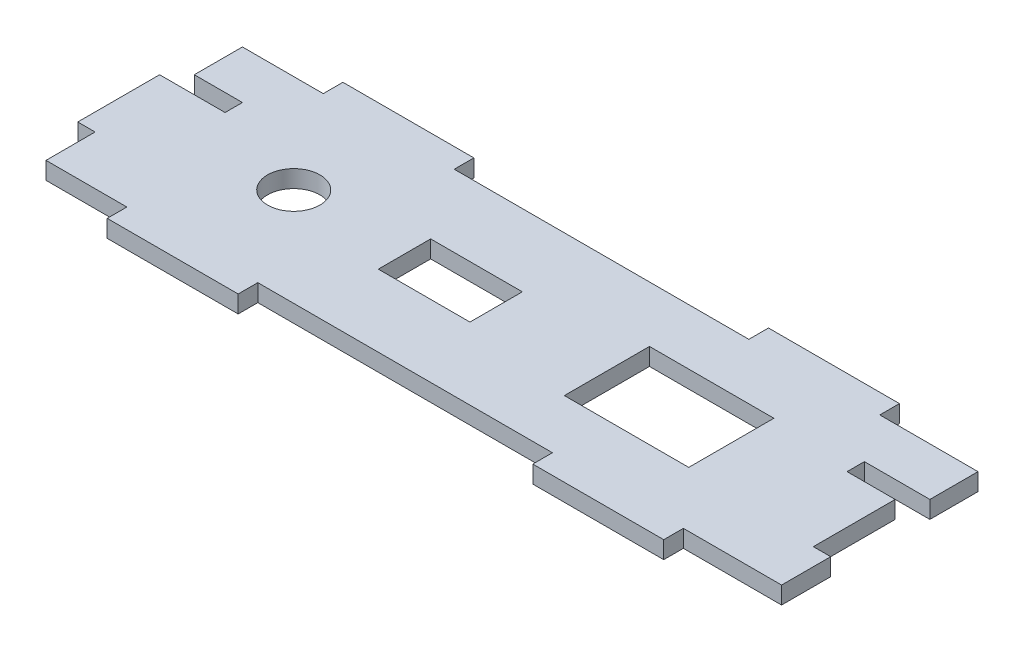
from build123d import *

# Parameters (mm, degrees)
CROQUIS1_W              = 115
CROQUIS1_H              = 2.65
SALIENTE_EXTRUIR1_DEPTH = 30
CROQUIS2_W              = 20
CROQUIS2_H              = 2.65
SALIENTE_EXTRUIR2_DEPTH = 3
CROQUIS3_W              = 2.65
CROQUIS3_H              = 15
CROQUIS3_H_2            = 7.5
CORTAR_EXTRUIR1_DEPTH   = 2.65
CROQUIS4_W              = 10
CROQUIS4_H              = 2.65
CORTAR_EXTRUIR2_DEPTH   = 3
CROQUIS5_W              = 19
CROQUIS5_H              = 13
CORTAR_EXTRUIR3_DEPTH   = 2.65
CORTAR_EXTRUIR4_REACH   = 126.483
CROQUIS6_R              = 4
CORTAR_EXTRUIR5_REACH   = 126.483
CROQUIS7_W              = 14
CROQUIS7_H              = 8


with BuildPart() as part:
    # Croquis1 → Saliente-Extruir1 (new body)
    with BuildSketch(Plane.XY):
        with Locations((62.5, 118.675)):
            Rectangle(CROQUIS1_W, CROQUIS1_H)
    extrude(amount=SALIENTE_EXTRUIR1_DEPTH)

    # Croquis2 → Saliente-Extruir2 (add)
    with BuildSketch(Plane(origin=(0, 0, 0), x_dir=(-1, 0, 0), z_dir=(0, 0, -1))):
        with Locations((-30, 118.675)):
            Rectangle(CROQUIS2_W, CROQUIS2_H)
        with Locations((-95, 118.675)):
            Rectangle(CROQUIS2_W, CROQUIS2_H)
    saliente_extruir2 = extrude(amount=SALIENTE_EXTRUIR2_DEPTH)

    # Croquis3 → Cortar-Extruir1 (cut)
    with BuildSketch(Plane(origin=(0, 120, 0), x_dir=(1, 0, 0), z_dir=(0, 1, 0))):
        with Locations((118.675, -15)):
            Rectangle(CROQUIS3_W, CROQUIS3_H)
        with Locations((6.325, -26.25)):
            Rectangle(CROQUIS3_W, CROQUIS3_H_2)
        with Locations((6.325, -3.75)):
            Rectangle(CROQUIS3_W, CROQUIS3_H_2)
    extrude(amount=-CORTAR_EXTRUIR1_DEPTH, mode=Mode.SUBTRACT)

    # Simetr_a1: Saliente-Extruir2 across plane
    add(saliente_extruir2.mirror(Plane.XY.offset(15)))

    # Croquis4 → Cortar-Extruir2 (cut)
    with BuildSketch(Plane(origin=(0, 120, 0), x_dir=(1, 0, 0), z_dir=(0, 1, 0))):
        with Locations((10, -8.675)):
            Rectangle(CROQUIS4_W, CROQUIS4_H)
        with Locations((115, -8.675)):
            Rectangle(CROQUIS4_W, CROQUIS4_H)
    extrude(amount=-CORTAR_EXTRUIR2_DEPTH, mode=Mode.SUBTRACT)

    # Croquis5 → Cortar-Extruir3 (cut)
    with BuildSketch(Plane(origin=(0, 120, 0), x_dir=(1, 0, 0), z_dir=(0, 1, 0))):
        with Locations((87.85, -15.028519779)):
            Rectangle(CROQUIS5_W, CROQUIS5_H)
    extrude(amount=-CORTAR_EXTRUIR3_DEPTH, mode=Mode.SUBTRACT)

    # Croquis6 → Cortar-Extruir4 (cut, up to next)
    with BuildSketch(Plane(origin=(0, 120, 0), x_dir=(1, 0, 0), z_dir=(0, 1, 0)), mode=Mode.PRIVATE) as cortar_extruir4_sk1:
        with Locations(Location((30.48651195, -15, 0), (0, 0, 180))):
            Circle(CROQUIS6_R)
    cortar_extruir4_tool1 = extrude(cortar_extruir4_sk1.sketch, amount=-CORTAR_EXTRUIR4_REACH, mode=Mode.PRIVATE) & part.part
    add(cortar_extruir4_tool1.solids().sort_by_distance((30.486512, 120, 15))[0], mode=Mode.SUBTRACT)

    # Croquis7 → Cortar-Extruir5 (cut, up to next)
    with BuildSketch(Plane(origin=(0, 120, 0), x_dir=(1, 0, 0), z_dir=(0, 1, 0)), mode=Mode.PRIVATE) as cortar_extruir5_sk1:
        with Locations((54.418255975, -15.01425989)):
            Rectangle(CROQUIS7_W, CROQUIS7_H)
    cortar_extruir5_tool1 = extrude(cortar_extruir5_sk1.sketch, amount=-CORTAR_EXTRUIR5_REACH, mode=Mode.PRIVATE) & part.part
    add(cortar_extruir5_tool1.solids().sort_by_distance((54.418256, 120, 15.01426))[0], mode=Mode.SUBTRACT)


solid = part.part
